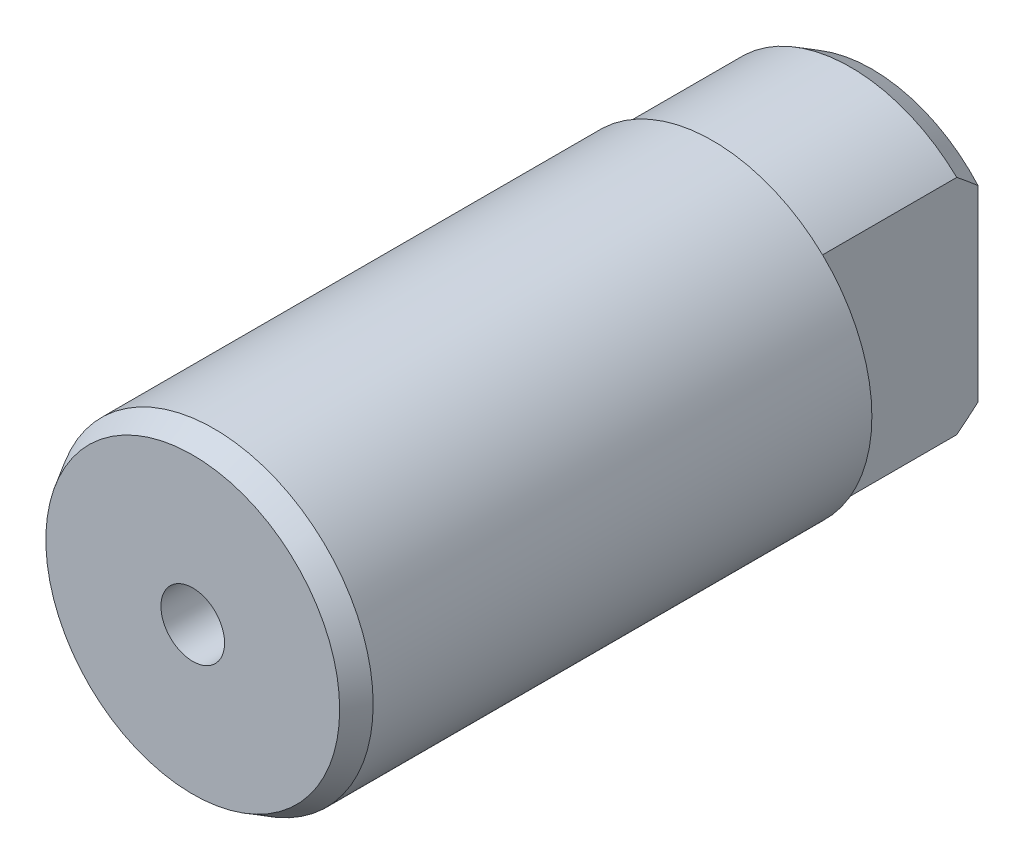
ISO-10303-21;
HEADER;
FILE_DESCRIPTION(('STEP AP214'),'2;1');
FILE_NAME('part.step','',(''),(''),'','','');
FILE_SCHEMA(('AUTOMOTIVE_DESIGN { 1 0 10303 214 1 1 1 1 }'));
ENDSEC;
DATA;
#1=APPLICATION_CONTEXT('core data for automotive mechanical design processes');
#2=APPLICATION_PROTOCOL_DEFINITION('international standard','automotive_design',2000,#1);
#3=PRODUCT_CONTEXT('',#1,'mechanical');
#4=PRODUCT('Part','Part','',(#3));
#5=PRODUCT_RELATED_PRODUCT_CATEGORY('part','',(#4));
#6=PRODUCT_DEFINITION_FORMATION('','',#4);
#7=PRODUCT_DEFINITION_CONTEXT('part definition',#1,'design');
#8=PRODUCT_DEFINITION('design','',#6,#7);
#9=PRODUCT_DEFINITION_SHAPE('','',#8);
#10=(LENGTH_UNIT() NAMED_UNIT(*) SI_UNIT(.MILLI.,.METRE.));
#11=(NAMED_UNIT(*) PLANE_ANGLE_UNIT() SI_UNIT($,.RADIAN.));
#12=(NAMED_UNIT(*) SI_UNIT($,.STERADIAN.) SOLID_ANGLE_UNIT());
#13=UNCERTAINTY_MEASURE_WITH_UNIT(LENGTH_MEASURE(1.E-05),#10,'distance_accuracy_value','');
#14=(GEOMETRIC_REPRESENTATION_CONTEXT(3) GLOBAL_UNCERTAINTY_ASSIGNED_CONTEXT((#13)) GLOBAL_UNIT_ASSIGNED_CONTEXT((#10,
#11,#12)) REPRESENTATION_CONTEXT('',''));
#15=CARTESIAN_POINT('',(0.,0.,0.));
#16=DIRECTION('',(0.,0.,1.));
#17=DIRECTION('',(1.,0.,0.));
#18=AXIS2_PLACEMENT_3D('',#15,#16,#17);
#19=CARTESIAN_POINT('',(0.,0.,-13.));
#20=DIRECTION('',(0.,0.,1.));
#21=DIRECTION('',(1.,0.,0.));
#22=AXIS2_PLACEMENT_3D('',#19,#20,#21);
#23=CONICAL_SURFACE('',#22,14.5,0.523598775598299);
#24=CARTESIAN_POINT('',(-10.,-4.61603811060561,-19.0379596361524));
#25=CARTESIAN_POINT('',(-10.,-4.7499488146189,-18.9407341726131));
#26=CARTESIAN_POINT('',(-10.,-4.88220238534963,-18.8412597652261));
#27=CARTESIAN_POINT('',(-10.,-5.14360691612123,-18.6383677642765));
#28=CARTESIAN_POINT('',(-10.,-5.27275854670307,-18.5349510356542));
#29=CARTESIAN_POINT('',(-10.,-5.52810494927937,-18.3247883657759));
#30=CARTESIAN_POINT('',(-10.,-5.65430247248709,-18.2180457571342));
#31=CARTESIAN_POINT('',(-10.,-5.90409960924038,-18.001554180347));
#32=CARTESIAN_POINT('',(-10.,-6.02769906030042,-17.8918050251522));
#33=CARTESIAN_POINT('',(-10.,-6.39412254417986,-17.5593341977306));
#34=CARTESIAN_POINT('',(-10.,-6.63340183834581,-17.3326984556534));
#35=CARTESIAN_POINT('',(-10.,-7.1039854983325,-16.8712180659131));
#36=CARTESIAN_POINT('',(-10.,-7.33528753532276,-16.6363710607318));
#37=CARTESIAN_POINT('',(-10.,-7.78993833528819,-16.1613470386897));
#38=CARTESIAN_POINT('',(-10.,-8.0133208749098,-15.9212022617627));
#39=CARTESIAN_POINT('',(-10.,-8.45432654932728,-15.4356711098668));
#40=CARTESIAN_POINT('',(-10.,-8.6719493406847,-15.1902844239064));
#41=CARTESIAN_POINT('',(-10.,-9.10243360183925,-14.6949761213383));
#42=CARTESIAN_POINT('',(-10.,-9.315290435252,-14.4450504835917));
#43=CARTESIAN_POINT('',(-10.,-9.73670651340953,-13.9415994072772));
#44=CARTESIAN_POINT('',(-10.,-9.94526566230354,-13.6880738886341));
#45=CARTESIAN_POINT('',(-10.,-10.4005896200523,-13.1262311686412));
#46=CARTESIAN_POINT('',(-10.,-10.6465178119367,-12.8172365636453));
#47=CARTESIAN_POINT('',(-10.,-11.1337558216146,-12.1956286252));
#48=CARTESIAN_POINT('',(-10.,-11.3750655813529,-11.8830152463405));
#49=CARTESIAN_POINT('',(-10.,-11.8537301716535,-11.2547370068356));
#50=CARTESIAN_POINT('',(-10.,-12.0910846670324,-10.9390718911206));
#51=CARTESIAN_POINT('',(-10.,-12.5623462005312,-10.3051765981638));
#52=CARTESIAN_POINT('',(-10.,-12.7962531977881,-9.98694639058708));
#53=CARTESIAN_POINT('',(-10.,-13.493482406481,-9.0289817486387));
#54=CARTESIAN_POINT('',(-10.,-13.9523110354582,-8.38597567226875));
#55=CARTESIAN_POINT('',(-10.,-14.8606973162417,-7.09344959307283));
#56=CARTESIAN_POINT('',(-10.,-15.3102547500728,-6.44392943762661));
#57=CARTESIAN_POINT('',(-10.,-15.9816025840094,-5.46215206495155));
#58=CARTESIAN_POINT('',(-10.,-16.2061387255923,-5.13176767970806));
#59=CARTESIAN_POINT('',(-10.,-16.6535127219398,-4.46985811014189));
#60=CARTESIAN_POINT('',(-10.,-16.8763506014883,-4.13833294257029));
#61=CARTESIAN_POINT('',(-10.,-17.542597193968,-3.14221736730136));
#62=CARTESIAN_POINT('',(-10.,-17.9837279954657,-2.47610281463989));
#63=CARTESIAN_POINT('',(-10.,-18.8605947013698,-1.14130311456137));
#64=CARTESIAN_POINT('',(-10.,-19.2963356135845,-0.472621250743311));
#65=CARTESIAN_POINT('',(-10.,-20.163661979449,0.867388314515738));
#66=CARTESIAN_POINT('',(-10.,-20.5952476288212,1.5387158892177));
#67=CARTESIAN_POINT('',(-10.,-21.0251689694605,2.2111010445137));
#68=B_SPLINE_CURVE_WITH_KNOTS('',3,(#24,#25,#26,#27,#28,#29,#30,#31,#32,#33,#34,#35,#36,#37,#38,
#39,#40,#41,#42,#43,#44,#45,#46,#47,#48,#49,#50,#51,#52,#53,#54,#55,#56,#57,#58,#59,#60,#61,#62,
#63,#64,#65,#66,#67),.UNSPECIFIED.,.F.,.F.,(4,2,2,2,2,2,2,2,2,2,2,2,2,2,2,2,2,2,2,2,2,4),(0.,
0.496398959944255,0.992689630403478,1.48849805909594,1.98433740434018,2.97277932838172,
3.96150741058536,4.94532811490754,5.92920735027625,6.91400542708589,7.89882544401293,
9.0835183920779,10.268226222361,11.453033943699,12.6378556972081,15.0075081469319,
17.3772162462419,18.5755993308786,19.7739648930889,22.1707538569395,24.5651172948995,
26.9593673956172),.UNSPECIFIED.);
#69=CARTESIAN_POINT('',(-10.,-8.83725170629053,-15.));
#70=VERTEX_POINT('',#69);
#71=CARTESIAN_POINT('',(-10.,-10.5,-13.));
#72=VERTEX_POINT('',#71);
#73=EDGE_CURVE('E29',#70,#72,#68,.T.);
#74=ORIENTED_EDGE('',*,*,#73,.F.);
#75=CARTESIAN_POINT('',(0.,0.,-15.));
#76=DIRECTION('',(0.,0.,1.));
#77=DIRECTION('',(1.,0.,0.));
#78=AXIS2_PLACEMENT_3D('',#75,#76,#77);
#79=CIRCLE('',#78,13.3452994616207);
#80=CARTESIAN_POINT('',(10.,-8.83725170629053,-15.));
#81=VERTEX_POINT('',#80);
#82=EDGE_CURVE('E99',#70,#81,#79,.T.);
#83=ORIENTED_EDGE('',*,*,#82,.T.);
#84=CARTESIAN_POINT('',(10.,-4.61603817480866,-19.0379595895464));
#85=CARTESIAN_POINT('',(10.,-4.74994887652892,-18.9407341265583));
#86=CARTESIAN_POINT('',(10.,-4.88220244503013,-18.8412597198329));
#87=CARTESIAN_POINT('',(10.,-5.14360697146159,-18.6383677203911));
#88=CARTESIAN_POINT('',(10.,-5.27275859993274,-18.5349509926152));
#89=CARTESIAN_POINT('',(10.,-5.52810499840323,-18.3247883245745));
#90=CARTESIAN_POINT('',(10.,-5.65430251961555,-18.2180457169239));
#91=CARTESIAN_POINT('',(10.,-5.90409965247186,-18.0015541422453));
#92=CARTESIAN_POINT('',(10.,-6.02769910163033,-17.8918049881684));
#93=CARTESIAN_POINT('',(10.,-6.39412257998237,-17.5593341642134));
#94=CARTESIAN_POINT('',(10.,-6.63340187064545,-17.3326984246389));
#95=CARTESIAN_POINT('',(10.,-7.10398552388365,-16.8712180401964));
#96=CARTESIAN_POINT('',(10.,-7.33528755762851,-16.6363710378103));
#97=CARTESIAN_POINT('',(10.,-7.78993835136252,-16.1613470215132));
#98=CARTESIAN_POINT('',(10.,-8.01332088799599,-15.9212022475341));
#99=CARTESIAN_POINT('',(10.,-8.45432655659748,-15.4356711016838));
#100=CARTESIAN_POINT('',(10.,-8.67194934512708,-15.1902844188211));
#101=CARTESIAN_POINT('',(10.,-9.10243360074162,-14.6949761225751));
#102=CARTESIAN_POINT('',(10.,-9.31529043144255,-14.445050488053));
#103=CARTESIAN_POINT('',(10.,-9.73670650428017,-13.9415994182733));
#104=CARTESIAN_POINT('',(10.,-9.94526565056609,-13.6880739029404));
#105=CARTESIAN_POINT('',(10.,-10.4005896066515,-13.12623118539));
#106=CARTESIAN_POINT('',(10.,-10.6465177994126,-12.8172365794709));
#107=CARTESIAN_POINT('',(10.,-11.1337558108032,-12.1956286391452));
#108=CARTESIAN_POINT('',(10.,-11.3750655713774,-11.8830152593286));
#109=CARTESIAN_POINT('',(10.,-11.8537301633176,-11.2547370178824));
#110=CARTESIAN_POINT('',(10.,-12.0910846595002,-10.9390719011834));
#111=CARTESIAN_POINT('',(10.,-12.5623461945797,-10.3051766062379));
#112=CARTESIAN_POINT('',(10.,-12.7962531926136,-9.9869463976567));
#113=CARTESIAN_POINT('',(10.,-13.493482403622,-9.02898175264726));
#114=CARTESIAN_POINT('',(10.,-13.9523110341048,-8.38597567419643));
#115=CARTESIAN_POINT('',(10.,-14.8606973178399,-7.0934495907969));
#116=CARTESIAN_POINT('',(10.,-15.310254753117,-6.44392943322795));
#117=CARTESIAN_POINT('',(10.,-15.9816025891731,-5.46215205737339));
#118=CARTESIAN_POINT('',(10.,-16.2061387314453,-5.13176767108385));
#119=CARTESIAN_POINT('',(10.,-16.6535127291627,-4.4698580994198));
#120=CARTESIAN_POINT('',(10.,-16.8763506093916,-4.13833293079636));
#121=CARTESIAN_POINT('',(10.,-17.5425972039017,-3.14221735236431));
#122=CARTESIAN_POINT('',(10.,-17.9837280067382,-2.47610279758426));
#123=CARTESIAN_POINT('',(10.,-18.8605947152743,-1.14130309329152));
#124=CARTESIAN_POINT('',(10.,-19.2963356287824,-0.472621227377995));
#125=CARTESIAN_POINT('',(10.,-20.1636619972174,0.867388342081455));
#126=CARTESIAN_POINT('',(10.,-20.5952476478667,1.53871591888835));
#127=CARTESIAN_POINT('',(10.,-21.0251689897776,2.21110107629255));
#128=B_SPLINE_CURVE_WITH_KNOTS('',3,(#84,#85,#86,#87,#88,#89,#90,#91,#92,#93,#94,#95,#96,#97,
#98,#99,#100,#101,#102,#103,#104,#105,#106,#107,#108,#109,#110,#111,#112,#113,#114,#115,#116,
#117,#118,#119,#120,#121,#122,#123,#124,#125,#126,#127),.UNSPECIFIED.,.F.,.F.,(4,2,2,2,2,2,2,2,
2,2,2,2,2,2,2,2,2,2,2,2,2,4),(0.,0.496398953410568,0.992689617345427,1.48849803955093,
1.98433737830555,2.97277928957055,3.96150735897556,4.94532805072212,5.92920727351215,
6.91400533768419,7.89882534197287,9.08351829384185,10.2682261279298,11.4530338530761,
12.6378556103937,15.0075080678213,17.377216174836,18.5755992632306,19.7739648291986,
22.1707538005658,24.5651172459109,26.9593673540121),.UNSPECIFIED.);
#129=CARTESIAN_POINT('',(10.,-10.5,-13.));
#130=VERTEX_POINT('',#129);
#131=EDGE_CURVE('E86',#81,#130,#128,.T.);
#132=ORIENTED_EDGE('',*,*,#131,.T.);
#133=CARTESIAN_POINT('',(0.,0.,-13.));
#134=DIRECTION('',(0.,0.,1.));
#135=DIRECTION('',(1.,0.,0.));
#136=AXIS2_PLACEMENT_3D('',#133,#134,#135);
#137=CIRCLE('',#136,14.5);
#138=EDGE_CURVE('E84',#72,#130,#137,.T.);
#139=ORIENTED_EDGE('',*,*,#138,.F.);
#140=EDGE_LOOP('',(#74,#83,#132,#139));
#141=FACE_BOUND('',#140,.T.);
#142=ADVANCED_FACE('F14',(#141),#23,.T.);
#143=CARTESIAN_POINT('',(0.,0.,85.));
#144=DIRECTION('',(0.,0.,1.));
#145=DIRECTION('',(1.,0.,0.));
#146=AXIS2_PLACEMENT_3D('',#143,#144,#145);
#147=CYLINDRICAL_SURFACE('',#146,14.5);
#148=DIRECTION('',(0.,0.,1.));
#149=VECTOR('',#148,1.);
#150=CARTESIAN_POINT('',(-10.,10.5,85.));
#151=LINE('',#150,#149);
#152=CARTESIAN_POINT('',(-10.,10.5,0.));
#153=VERTEX_POINT('',#152);
#154=CARTESIAN_POINT('',(-10.,10.5,-13.));
#155=VERTEX_POINT('',#154);
#156=EDGE_CURVE('E152',#153,#155,#151,.F.);
#157=ORIENTED_EDGE('',*,*,#156,.F.);
#158=CARTESIAN_POINT('',(0.,0.,0.));
#159=DIRECTION('',(0.,0.,1.));
#160=DIRECTION('',(1.,0.,0.));
#161=AXIS2_PLACEMENT_3D('',#158,#159,#160);
#162=CIRCLE('',#161,14.5);
#163=CARTESIAN_POINT('',(10.,10.5,0.));
#164=VERTEX_POINT('',#163);
#165=EDGE_CURVE('E77',#164,#153,#162,.T.);
#166=ORIENTED_EDGE('',*,*,#165,.F.);
#167=DIRECTION('',(0.,0.,1.));
#168=VECTOR('',#167,1.);
#169=CARTESIAN_POINT('',(10.,10.5,85.));
#170=LINE('',#169,#168);
#171=CARTESIAN_POINT('',(10.,10.5,-13.));
#172=VERTEX_POINT('',#171);
#173=EDGE_CURVE('E9',#164,#172,#170,.F.);
#174=ORIENTED_EDGE('',*,*,#173,.T.);
#175=EDGE_CURVE('E96',#172,#155,#137,.T.);
#176=ORIENTED_EDGE('',*,*,#175,.T.);
#177=EDGE_LOOP('',(#157,#166,#174,#176));
#178=FACE_BOUND('',#177,.T.);
#179=ADVANCED_FACE('F130',(#178),#147,.T.);
#180=CARTESIAN_POINT('',(13.3452994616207,0.,-15.));
#181=DIRECTION('',(0.,0.,-1.));
#182=DIRECTION('',(-1.,0.,0.));
#183=AXIS2_PLACEMENT_3D('',#180,#181,#182);
#184=PLANE('',#183);
#185=DIRECTION('',(0.,1.,0.));
#186=VECTOR('',#185,1.);
#187=CARTESIAN_POINT('',(-10.,-20.,-15.));
#188=LINE('',#187,#186);
#189=CARTESIAN_POINT('',(-10.,8.83725170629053,-15.));
#190=VERTEX_POINT('',#189);
#191=EDGE_CURVE('E72',#70,#190,#188,.T.);
#192=ORIENTED_EDGE('',*,*,#191,.T.);
#193=CARTESIAN_POINT('',(10.,8.83725170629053,-15.));
#194=VERTEX_POINT('',#193);
#195=EDGE_CURVE('E100',#194,#190,#79,.T.);
#196=ORIENTED_EDGE('',*,*,#195,.F.);
#197=DIRECTION('',(0.,1.,0.));
#198=VECTOR('',#197,1.);
#199=CARTESIAN_POINT('',(10.,-20.,-15.));
#200=LINE('',#199,#198);
#201=EDGE_CURVE('E151',#81,#194,#200,.T.);
#202=ORIENTED_EDGE('',*,*,#201,.F.);
#203=ORIENTED_EDGE('',*,*,#82,.F.);
#204=EDGE_LOOP('',(#192,#196,#202,#203));
#205=FACE_BOUND('',#204,.T.);
#206=ADVANCED_FACE('F136',(#205),#184,.T.);
#207=CARTESIAN_POINT('',(-10.,21.0251689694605,2.2111010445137));
#208=CARTESIAN_POINT('',(-10.,20.5952476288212,1.5387158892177));
#209=CARTESIAN_POINT('',(-10.,20.163661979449,0.867388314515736));
#210=CARTESIAN_POINT('',(-10.,19.2963356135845,-0.472621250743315));
#211=CARTESIAN_POINT('',(-10.,18.8605947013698,-1.14130311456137));
#212=CARTESIAN_POINT('',(-10.,17.9837279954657,-2.47610281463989));
#213=CARTESIAN_POINT('',(-10.,17.542597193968,-3.14221736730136));
#214=CARTESIAN_POINT('',(-10.,16.8763506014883,-4.13833294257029));
#215=CARTESIAN_POINT('',(-10.,16.6535127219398,-4.46985811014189));
#216=CARTESIAN_POINT('',(-10.,16.2061387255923,-5.13176767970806));
#217=CARTESIAN_POINT('',(-10.,15.9816025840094,-5.46215206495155));
#218=CARTESIAN_POINT('',(-10.,15.3102547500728,-6.44392943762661));
#219=CARTESIAN_POINT('',(-10.,14.8606973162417,-7.09344959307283));
#220=CARTESIAN_POINT('',(-10.,13.9523110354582,-8.38597567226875));
#221=CARTESIAN_POINT('',(-10.,13.493482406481,-9.02898174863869));
#222=CARTESIAN_POINT('',(-10.,12.7962531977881,-9.98694639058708));
#223=CARTESIAN_POINT('',(-10.,12.5623462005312,-10.3051765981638));
#224=CARTESIAN_POINT('',(-10.,12.0910846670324,-10.9390718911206));
#225=CARTESIAN_POINT('',(-10.,11.8537301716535,-11.2547370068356));
#226=CARTESIAN_POINT('',(-10.,11.3750655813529,-11.8830152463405));
#227=CARTESIAN_POINT('',(-10.,11.1337558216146,-12.1956286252));
#228=CARTESIAN_POINT('',(-10.,10.6465178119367,-12.8172365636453));
#229=CARTESIAN_POINT('',(-10.,10.4005896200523,-13.1262311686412));
#230=CARTESIAN_POINT('',(-10.,9.94526566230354,-13.6880738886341));
#231=CARTESIAN_POINT('',(-10.,9.73670651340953,-13.9415994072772));
#232=CARTESIAN_POINT('',(-10.,9.315290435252,-14.4450504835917));
#233=CARTESIAN_POINT('',(-10.,9.10243360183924,-14.6949761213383));
#234=CARTESIAN_POINT('',(-10.,8.6719493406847,-15.1902844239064));
#235=CARTESIAN_POINT('',(-10.,8.45432654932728,-15.4356711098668));
#236=CARTESIAN_POINT('',(-10.,8.0133208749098,-15.9212022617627));
#237=CARTESIAN_POINT('',(-10.,7.78993833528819,-16.1613470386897));
#238=CARTESIAN_POINT('',(-10.,7.33528753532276,-16.6363710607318));
#239=CARTESIAN_POINT('',(-10.,7.1039854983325,-16.8712180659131));
#240=CARTESIAN_POINT('',(-10.,6.63340183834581,-17.3326984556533));
#241=CARTESIAN_POINT('',(-10.,6.39412254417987,-17.5593341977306));
#242=CARTESIAN_POINT('',(-10.,6.02769906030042,-17.8918050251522));
#243=CARTESIAN_POINT('',(-10.,5.90409960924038,-18.001554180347));
#244=CARTESIAN_POINT('',(-10.,5.65430247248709,-18.2180457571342));
#245=CARTESIAN_POINT('',(-10.,5.52810494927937,-18.3247883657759));
#246=CARTESIAN_POINT('',(-10.,5.27275854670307,-18.5349510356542));
#247=CARTESIAN_POINT('',(-10.,5.14360691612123,-18.6383677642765));
#248=CARTESIAN_POINT('',(-10.,4.88220238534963,-18.8412597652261));
#249=CARTESIAN_POINT('',(-10.,4.7499488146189,-18.9407341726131));
#250=CARTESIAN_POINT('',(-10.,4.61603811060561,-19.0379596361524));
#251=B_SPLINE_CURVE_WITH_KNOTS('',3,(#207,#208,#209,#210,#211,#212,#213,#214,#215,#216,#217,
#218,#219,#220,#221,#222,#223,#224,#225,#226,#227,#228,#229,#230,#231,#232,#233,#234,#235,#236,
#237,#238,#239,#240,#241,#242,#243,#244,#245,#246,#247,#248,#249,#250),.UNSPECIFIED.,.F.,.F.,(4,
2,2,2,2,2,2,2,2,2,2,2,2,2,2,2,2,2,2,2,2,4),(0.,2.39425010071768,4.78861353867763,
7.18540250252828,8.38376806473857,9.58215114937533,11.9518592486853,14.3215116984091,
15.5063334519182,16.6911411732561,17.8758490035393,19.0605419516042,20.0453619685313,
21.0301600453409,22.0140392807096,22.9978599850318,23.9865880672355,24.975029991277,
25.4708693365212,25.9666777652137,26.4629684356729,26.9593673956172),.UNSPECIFIED.);
#252=EDGE_CURVE('E148',#155,#190,#251,.T.);
#253=ORIENTED_EDGE('',*,*,#252,.F.);
#254=ORIENTED_EDGE('',*,*,#175,.F.);
#255=CARTESIAN_POINT('',(10.,21.0251689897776,2.21110107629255));
#256=CARTESIAN_POINT('',(10.,20.5952476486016,1.53871592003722));
#257=CARTESIAN_POINT('',(10.,20.1636619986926,0.867388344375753));
#258=CARTESIAN_POINT('',(10.,19.2963356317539,-0.472621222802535));
#259=CARTESIAN_POINT('',(10.,18.8605947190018,-1.14130308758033));
#260=CARTESIAN_POINT('',(10.,17.9837280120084,-2.47610278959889));
#261=CARTESIAN_POINT('',(10.,17.5425972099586,-3.14221734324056));
#262=CARTESIAN_POINT('',(10.,16.8763506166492,-4.13833291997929));
#263=CARTESIAN_POINT('',(10.,16.6535127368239,-4.46985808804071));
#264=CARTESIAN_POINT('',(10.,16.2061387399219,-5.13176765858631));
#265=CARTESIAN_POINT('',(10.,15.9816025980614,-5.46215204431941));
#266=CARTESIAN_POINT('',(10.,15.3102547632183,-6.44392941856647));
#267=CARTESIAN_POINT('',(10.,14.8606973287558,-7.09344957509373));
#268=CARTESIAN_POINT('',(10.,13.9523110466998,-8.38597565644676));
#269=CARTESIAN_POINT('',(10.,13.4934824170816,-9.02898173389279));
#270=CARTESIAN_POINT('',(10.,12.7962532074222,-9.98694637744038));
#271=CARTESIAN_POINT('',(10.,12.5623462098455,-10.3051765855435));
#272=CARTESIAN_POINT('',(10.,12.0910846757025,-10.9390718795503));
#273=CARTESIAN_POINT('',(10.,11.8537301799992,-11.254736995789));
#274=CARTESIAN_POINT('',(10.,11.3750655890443,-11.8830152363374));
#275=CARTESIAN_POINT('',(10.,11.1337558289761,-12.1956286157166));
#276=CARTESIAN_POINT('',(10.,10.6465178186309,-12.8172365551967));
#277=CARTESIAN_POINT('',(10.,10.4005896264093,-13.1262311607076));
#278=CARTESIAN_POINT('',(10.,9.94526567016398,-13.6880738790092));
#279=CARTESIAN_POINT('',(10.,9.73670652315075,-13.9415993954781));
#280=CARTESIAN_POINT('',(10.,9.31529044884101,-14.445050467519));
#281=CARTESIAN_POINT('',(10.,9.10243361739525,-14.6949761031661));
#282=CARTESIAN_POINT('',(10.,8.67194936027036,-15.190284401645));
#283=CARTESIAN_POINT('',(10.,8.45432657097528,-15.4356710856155));
#284=CARTESIAN_POINT('',(10.,8.01332090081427,-15.9212022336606));
#285=CARTESIAN_POINT('',(10.,7.78993836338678,-16.1613470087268));
#286=CARTESIAN_POINT('',(10.,7.33528756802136,-16.6363710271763));
#287=CARTESIAN_POINT('',(10.,7.10398553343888,-16.8712180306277));
#288=CARTESIAN_POINT('',(10.,6.63340187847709,-17.3326984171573));
#289=CARTESIAN_POINT('',(10.,6.39412258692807,-17.5593341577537));
#290=CARTESIAN_POINT('',(10.,6.02769910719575,-17.8918049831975));
#291=CARTESIAN_POINT('',(10.,5.90409965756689,-18.0015541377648));
#292=CARTESIAN_POINT('',(10.,5.65430252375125,-18.2180457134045));
#293=CARTESIAN_POINT('',(10.,5.52810500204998,-18.3247883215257));
#294=CARTESIAN_POINT('',(10.,5.27275860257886,-18.5349509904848));
#295=CARTESIAN_POINT('',(10.,5.143606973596,-18.6383677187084));
#296=CARTESIAN_POINT('',(10.,4.88220244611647,-18.8412597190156));
#297=CARTESIAN_POINT('',(10.,4.74994887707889,-18.9407341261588));
#298=CARTESIAN_POINT('',(10.,4.61603817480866,-19.0379595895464));
#299=B_SPLINE_CURVE_WITH_KNOTS('',3,(#255,#256,#257,#258,#259,#260,#261,#262,#263,#264,#265,
#266,#267,#268,#269,#270,#271,#272,#273,#274,#275,#276,#277,#278,#279,#280,#281,#282,#283,#284,
#285,#286,#287,#288,#289,#290,#291,#292,#293,#294,#295,#296,#297,#298),.UNSPECIFIED.,.F.,.F.,(4,
2,2,2,2,2,2,2,2,2,2,2,2,2,2,2,2,2,2,2,2,4),(0.,2.39425010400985,4.78861354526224,
7.18540251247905,8.38376807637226,9.58215116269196,11.9518592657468,14.3215117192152,
15.5063334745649,16.6911411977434,17.8758490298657,19.0605419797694,20.0453619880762,
21.0301600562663,22.0140392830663,22.9978599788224,23.9865880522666,24.9750299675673,
25.4708693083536,25.9666777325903,26.4629683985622,26.9593673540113),.UNSPECIFIED.);
#300=EDGE_CURVE('E82',#172,#194,#299,.T.);
#301=ORIENTED_EDGE('',*,*,#300,.T.);
#302=ORIENTED_EDGE('',*,*,#195,.T.);
#303=EDGE_LOOP('',(#253,#254,#301,#302));
#304=FACE_BOUND('',#303,.T.);
#305=ADVANCED_FACE('F128',(#304),#23,.T.);
#306=DIRECTION('',(0.,0.,1.));
#307=VECTOR('',#306,1.);
#308=CARTESIAN_POINT('',(-10.,-10.5,85.));
#309=LINE('',#308,#307);
#310=CARTESIAN_POINT('',(-10.,-10.5,0.));
#311=VERTEX_POINT('',#310);
#312=EDGE_CURVE('E66',#72,#311,#309,.T.);
#313=ORIENTED_EDGE('',*,*,#312,.F.);
#314=ORIENTED_EDGE('',*,*,#138,.T.);
#315=DIRECTION('',(0.,0.,1.));
#316=VECTOR('',#315,1.);
#317=CARTESIAN_POINT('',(10.,-10.5,85.));
#318=LINE('',#317,#316);
#319=CARTESIAN_POINT('',(10.,-10.5,0.));
#320=VERTEX_POINT('',#319);
#321=EDGE_CURVE('E22',#130,#320,#318,.T.);
#322=ORIENTED_EDGE('',*,*,#321,.T.);
#323=EDGE_CURVE('E37',#311,#320,#162,.T.);
#324=ORIENTED_EDGE('',*,*,#323,.F.);
#325=EDGE_LOOP('',(#313,#314,#322,#324));
#326=FACE_BOUND('',#325,.T.);
#327=ADVANCED_FACE('F80',(#326),#147,.T.);
#328=CARTESIAN_POINT('',(15.,0.,0.));
#329=DIRECTION('',(0.,0.,-1.));
#330=DIRECTION('',(-1.,0.,0.));
#331=AXIS2_PLACEMENT_3D('',#328,#329,#330);
#332=PLANE('',#331);
#333=ORIENTED_EDGE('',*,*,#165,.T.);
#334=DIRECTION('',(0.,1.,0.));
#335=VECTOR('',#334,1.);
#336=CARTESIAN_POINT('',(-10.,-20.,0.));
#337=LINE('',#336,#335);
#338=EDGE_CURVE('E68',#311,#153,#337,.T.);
#339=ORIENTED_EDGE('',*,*,#338,.F.);
#340=ORIENTED_EDGE('',*,*,#323,.T.);
#341=DIRECTION('',(0.,1.,0.));
#342=VECTOR('',#341,1.);
#343=CARTESIAN_POINT('',(10.,-20.,0.));
#344=LINE('',#343,#342);
#345=EDGE_CURVE('E156',#320,#164,#344,.T.);
#346=ORIENTED_EDGE('',*,*,#345,.T.);
#347=EDGE_LOOP('',(#333,#339,#340,#346));
#348=FACE_BOUND('',#347,.T.);
#349=CARTESIAN_POINT('',(0.,0.,0.));
#350=DIRECTION('',(0.,0.,1.));
#351=DIRECTION('',(1.,0.,0.));
#352=AXIS2_PLACEMENT_3D('',#349,#350,#351);
#353=CIRCLE('',#352,15.);
#354=CARTESIAN_POINT('',(15.,0.,0.));
#355=VERTEX_POINT('',#354);
#356=EDGE_CURVE('E115',#355,#355,#353,.T.);
#357=ORIENTED_EDGE('',*,*,#356,.F.);
#358=EDGE_LOOP('',(#357));
#359=FACE_BOUND('',#358,.T.);
#360=ADVANCED_FACE('F16',(#348,#359),#332,.T.);
#361=CARTESIAN_POINT('',(0.,0.,85.));
#362=DIRECTION('',(0.,0.,1.));
#363=DIRECTION('',(1.,0.,0.));
#364=AXIS2_PLACEMENT_3D('',#361,#362,#363);
#365=CYLINDRICAL_SURFACE('',#364,15.);
#366=ORIENTED_EDGE('',*,*,#356,.T.);
#367=EDGE_LOOP('',(#366));
#368=FACE_BOUND('',#367,.T.);
#369=CARTESIAN_POINT('',(0.,0.,47.));
#370=DIRECTION('',(0.,0.,1.));
#371=DIRECTION('',(1.,0.,0.));
#372=AXIS2_PLACEMENT_3D('',#369,#370,#371);
#373=CIRCLE('',#372,15.);
#374=CARTESIAN_POINT('',(15.,0.,47.));
#375=VERTEX_POINT('',#374);
#376=EDGE_CURVE('E112',#375,#375,#373,.T.);
#377=ORIENTED_EDGE('',*,*,#376,.F.);
#378=EDGE_LOOP('',(#377));
#379=FACE_BOUND('',#378,.T.);
#380=ADVANCED_FACE('F119',(#368,#379),#365,.T.);
#381=CARTESIAN_POINT('',(0.,0.,47.));
#382=DIRECTION('',(0.,0.,-1.));
#383=DIRECTION('',(-1.,0.,0.));
#384=AXIS2_PLACEMENT_3D('',#381,#382,#383);
#385=CONICAL_SURFACE('',#384,15.,0.523598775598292);
#386=CARTESIAN_POINT('',(0.,0.,49.));
#387=DIRECTION('',(0.,0.,1.));
#388=DIRECTION('',(1.,0.,0.));
#389=AXIS2_PLACEMENT_3D('',#386,#387,#388);
#390=CIRCLE('',#389,13.8452994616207);
#391=CARTESIAN_POINT('',(13.8452994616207,0.,49.));
#392=VERTEX_POINT('',#391);
#393=EDGE_CURVE('E109',#392,#392,#390,.T.);
#394=ORIENTED_EDGE('',*,*,#393,.F.);
#395=EDGE_LOOP('',(#394));
#396=FACE_BOUND('',#395,.T.);
#397=ORIENTED_EDGE('',*,*,#376,.T.);
#398=EDGE_LOOP('',(#397));
#399=FACE_BOUND('',#398,.T.);
#400=ADVANCED_FACE('F127',(#396,#399),#385,.T.);
#401=CARTESIAN_POINT('',(3.,0.,49.));
#402=DIRECTION('',(0.,0.,1.));
#403=DIRECTION('',(1.,0.,0.));
#404=AXIS2_PLACEMENT_3D('',#401,#402,#403);
#405=PLANE('',#404);
#406=ORIENTED_EDGE('',*,*,#393,.T.);
#407=EDGE_LOOP('',(#406));
#408=FACE_BOUND('',#407,.T.);
#409=CARTESIAN_POINT('',(0.,0.,49.));
#410=DIRECTION('',(0.,0.,1.));
#411=DIRECTION('',(1.,0.,0.));
#412=AXIS2_PLACEMENT_3D('',#409,#410,#411);
#413=CIRCLE('',#412,3.);
#414=CARTESIAN_POINT('',(3.,0.,49.));
#415=VERTEX_POINT('',#414);
#416=EDGE_CURVE('E106',#415,#415,#413,.T.);
#417=ORIENTED_EDGE('',*,*,#416,.F.);
#418=EDGE_LOOP('',(#417));
#419=FACE_BOUND('',#418,.T.);
#420=ADVANCED_FACE('F211',(#408,#419),#405,.T.);
#421=CARTESIAN_POINT('',(0.,0.,85.));
#422=DIRECTION('',(0.,0.,1.));
#423=DIRECTION('',(1.,0.,0.));
#424=AXIS2_PLACEMENT_3D('',#421,#422,#423);
#425=CYLINDRICAL_SURFACE('',#424,3.);
#426=ORIENTED_EDGE('',*,*,#416,.T.);
#427=EDGE_LOOP('',(#426));
#428=FACE_BOUND('',#427,.T.);
#429=CARTESIAN_POINT('',(0.,0.,39.));
#430=DIRECTION('',(0.,0.,1.));
#431=DIRECTION('',(1.,0.,0.));
#432=AXIS2_PLACEMENT_3D('',#429,#430,#431);
#433=CIRCLE('',#432,3.);
#434=CARTESIAN_POINT('',(3.,0.,39.));
#435=VERTEX_POINT('',#434);
#436=EDGE_CURVE('E103',#435,#435,#433,.T.);
#437=ORIENTED_EDGE('',*,*,#436,.F.);
#438=EDGE_LOOP('',(#437));
#439=FACE_BOUND('',#438,.T.);
#440=ADVANCED_FACE('F202',(#428,#439),#425,.F.);
#441=CARTESIAN_POINT('',(0.,0.,39.));
#442=DIRECTION('',(0.,0.,1.));
#443=DIRECTION('',(1.,0.,0.));
#444=AXIS2_PLACEMENT_3D('',#441,#442,#443);
#445=PLANE('',#444);
#446=ORIENTED_EDGE('',*,*,#436,.T.);
#447=EDGE_LOOP('',(#446));
#448=FACE_BOUND('',#447,.T.);
#449=ADVANCED_FACE('F167',(#448),#445,.T.);
#450=CARTESIAN_POINT('',(10.,-20.,0.));
#451=DIRECTION('',(1.,0.,0.));
#452=DIRECTION('',(0.,0.,-1.));
#453=AXIS2_PLACEMENT_3D('',#450,#451,#452);
#454=PLANE('',#453);
#455=ORIENTED_EDGE('',*,*,#173,.F.);
#456=ORIENTED_EDGE('',*,*,#345,.F.);
#457=ORIENTED_EDGE('',*,*,#321,.F.);
#458=ORIENTED_EDGE('',*,*,#131,.F.);
#459=ORIENTED_EDGE('',*,*,#201,.T.);
#460=ORIENTED_EDGE('',*,*,#300,.F.);
#461=EDGE_LOOP('',(#455,#456,#457,#458,#459,#460));
#462=FACE_BOUND('',#461,.T.);
#463=ADVANCED_FACE('F155',(#462),#454,.T.);
#464=CARTESIAN_POINT('',(-10.,-20.,0.));
#465=DIRECTION('',(1.,0.,0.));
#466=DIRECTION('',(0.,0.,-1.));
#467=AXIS2_PLACEMENT_3D('',#464,#465,#466);
#468=PLANE('',#467);
#469=ORIENTED_EDGE('',*,*,#252,.T.);
#470=ORIENTED_EDGE('',*,*,#191,.F.);
#471=ORIENTED_EDGE('',*,*,#73,.T.);
#472=ORIENTED_EDGE('',*,*,#312,.T.);
#473=ORIENTED_EDGE('',*,*,#338,.T.);
#474=ORIENTED_EDGE('',*,*,#156,.T.);
#475=EDGE_LOOP('',(#469,#470,#471,#472,#473,#474));
#476=FACE_BOUND('',#475,.T.);
#477=ADVANCED_FACE('F67',(#476),#468,.F.);
#478=CLOSED_SHELL('',(#142,#179,#206,#305,#327,#360,#380,#400,#420,#440,#449,#463,#477));
#479=MANIFOLD_SOLID_BREP('B1',#478);
#480=ADVANCED_BREP_SHAPE_REPRESENTATION('',(#18,#479),#14);
#481=SHAPE_DEFINITION_REPRESENTATION(#9,#480);
ENDSEC;
END-ISO-10303-21;
